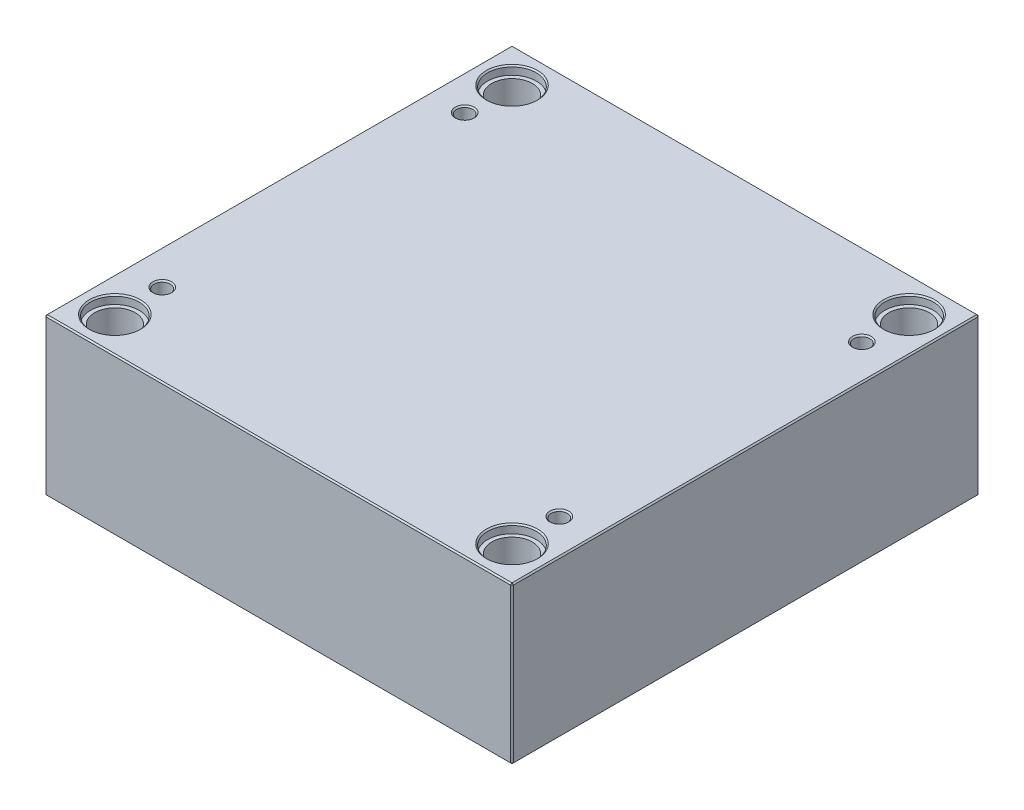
ISO-10303-21;
HEADER;
FILE_DESCRIPTION(('STEP AP214'),'2;1');
FILE_NAME('part.step','',(''),(''),'','','');
FILE_SCHEMA(('AUTOMOTIVE_DESIGN { 1 0 10303 214 1 1 1 1 }'));
ENDSEC;
DATA;
#1=APPLICATION_CONTEXT('core data for automotive mechanical design processes');
#2=APPLICATION_PROTOCOL_DEFINITION('international standard','automotive_design',2000,#1);
#3=PRODUCT_CONTEXT('',#1,'mechanical');
#4=PRODUCT('Part','Part','',(#3));
#5=PRODUCT_RELATED_PRODUCT_CATEGORY('part','',(#4));
#6=PRODUCT_DEFINITION_FORMATION('','',#4);
#7=PRODUCT_DEFINITION_CONTEXT('part definition',#1,'design');
#8=PRODUCT_DEFINITION('design','',#6,#7);
#9=PRODUCT_DEFINITION_SHAPE('','',#8);
#10=(LENGTH_UNIT() NAMED_UNIT(*) SI_UNIT(.MILLI.,.METRE.));
#11=(NAMED_UNIT(*) PLANE_ANGLE_UNIT() SI_UNIT($,.RADIAN.));
#12=(NAMED_UNIT(*) SI_UNIT($,.STERADIAN.) SOLID_ANGLE_UNIT());
#13=UNCERTAINTY_MEASURE_WITH_UNIT(LENGTH_MEASURE(1.E-05),#10,'distance_accuracy_value','');
#14=(GEOMETRIC_REPRESENTATION_CONTEXT(3) GLOBAL_UNCERTAINTY_ASSIGNED_CONTEXT((#13)) GLOBAL_UNIT_ASSIGNED_CONTEXT((#10,
#11,#12)) REPRESENTATION_CONTEXT('',''));
#15=CARTESIAN_POINT('',(0.,0.,0.));
#16=DIRECTION('',(0.,0.,1.));
#17=DIRECTION('',(1.,0.,0.));
#18=AXIS2_PLACEMENT_3D('',#15,#16,#17);
#19=CARTESIAN_POINT('',(-147.,0.,-147.));
#20=DIRECTION('',(0.,1.,0.));
#21=DIRECTION('',(0.,0.,1.));
#22=AXIS2_PLACEMENT_3D('',#19,#20,#21);
#23=CYLINDRICAL_SURFACE('',#22,15.);
#24=CARTESIAN_POINT('',(-147.,0.999999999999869,-147.));
#25=DIRECTION('',(0.,1.,0.));
#26=DIRECTION('',(0.,0.,1.));
#27=AXIS2_PLACEMENT_3D('',#24,#25,#26);
#28=CIRCLE('',#27,15.);
#29=CARTESIAN_POINT('',(-147.,0.999999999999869,-132.));
#30=VERTEX_POINT('',#29);
#31=EDGE_CURVE('E472',#30,#30,#28,.F.);
#32=ORIENTED_EDGE('',*,*,#31,.T.);
#33=EDGE_LOOP('',(#32));
#34=FACE_BOUND('',#33,.T.);
#35=CARTESIAN_POINT('',(-147.,109.7,-147.));
#36=DIRECTION('',(0.,1.,0.));
#37=DIRECTION('',(0.,0.,1.));
#38=AXIS2_PLACEMENT_3D('',#35,#36,#37);
#39=CIRCLE('',#38,15.);
#40=CARTESIAN_POINT('',(-147.,109.7,-132.));
#41=VERTEX_POINT('',#40);
#42=EDGE_CURVE('E221',#41,#41,#39,.F.);
#43=ORIENTED_EDGE('',*,*,#42,.F.);
#44=EDGE_LOOP('',(#43));
#45=FACE_BOUND('',#44,.T.);
#46=ADVANCED_FACE('F16',(#34,#45),#23,.F.);
#47=CARTESIAN_POINT('',(147.,0.,-147.));
#48=DIRECTION('',(0.,1.,0.));
#49=DIRECTION('',(0.,0.,1.));
#50=AXIS2_PLACEMENT_3D('',#47,#48,#49);
#51=CYLINDRICAL_SURFACE('',#50,15.);
#52=CARTESIAN_POINT('',(147.,0.999999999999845,-147.));
#53=DIRECTION('',(0.,1.,0.));
#54=DIRECTION('',(0.,0.,1.));
#55=AXIS2_PLACEMENT_3D('',#52,#53,#54);
#56=CIRCLE('',#55,15.);
#57=CARTESIAN_POINT('',(147.,0.999999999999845,-132.));
#58=VERTEX_POINT('',#57);
#59=EDGE_CURVE('E474',#58,#58,#56,.F.);
#60=ORIENTED_EDGE('',*,*,#59,.T.);
#61=EDGE_LOOP('',(#60));
#62=FACE_BOUND('',#61,.T.);
#63=CARTESIAN_POINT('',(147.,109.7,-147.));
#64=DIRECTION('',(0.,1.,0.));
#65=DIRECTION('',(0.,0.,1.));
#66=AXIS2_PLACEMENT_3D('',#63,#64,#65);
#67=CIRCLE('',#66,15.);
#68=CARTESIAN_POINT('',(147.,109.7,-132.));
#69=VERTEX_POINT('',#68);
#70=EDGE_CURVE('E218',#69,#69,#67,.F.);
#71=ORIENTED_EDGE('',*,*,#70,.F.);
#72=EDGE_LOOP('',(#71));
#73=FACE_BOUND('',#72,.T.);
#74=ADVANCED_FACE('F263',(#62,#73),#51,.F.);
#75=CARTESIAN_POINT('',(147.,0.,147.));
#76=DIRECTION('',(0.,1.,0.));
#77=DIRECTION('',(0.,0.,1.));
#78=AXIS2_PLACEMENT_3D('',#75,#76,#77);
#79=CYLINDRICAL_SURFACE('',#78,15.);
#80=CARTESIAN_POINT('',(147.,0.999999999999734,147.));
#81=DIRECTION('',(0.,1.,0.));
#82=DIRECTION('',(0.,0.,1.));
#83=AXIS2_PLACEMENT_3D('',#80,#81,#82);
#84=CIRCLE('',#83,15.);
#85=CARTESIAN_POINT('',(147.,0.999999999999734,162.));
#86=VERTEX_POINT('',#85);
#87=EDGE_CURVE('E477',#86,#86,#84,.F.);
#88=ORIENTED_EDGE('',*,*,#87,.T.);
#89=EDGE_LOOP('',(#88));
#90=FACE_BOUND('',#89,.T.);
#91=CARTESIAN_POINT('',(147.,109.7,147.));
#92=DIRECTION('',(0.,1.,0.));
#93=DIRECTION('',(0.,0.,1.));
#94=AXIS2_PLACEMENT_3D('',#91,#92,#93);
#95=CIRCLE('',#94,15.);
#96=CARTESIAN_POINT('',(147.,109.7,162.));
#97=VERTEX_POINT('',#96);
#98=EDGE_CURVE('E214',#97,#97,#95,.F.);
#99=ORIENTED_EDGE('',*,*,#98,.F.);
#100=EDGE_LOOP('',(#99));
#101=FACE_BOUND('',#100,.T.);
#102=ADVANCED_FACE('F270',(#90,#101),#79,.F.);
#103=CARTESIAN_POINT('',(-147.,0.,147.));
#104=DIRECTION('',(0.,1.,0.));
#105=DIRECTION('',(0.,0.,1.));
#106=AXIS2_PLACEMENT_3D('',#103,#104,#105);
#107=CYLINDRICAL_SURFACE('',#106,15.);
#108=CARTESIAN_POINT('',(-147.,0.999999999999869,147.));
#109=DIRECTION('',(0.,1.,0.));
#110=DIRECTION('',(0.,0.,1.));
#111=AXIS2_PLACEMENT_3D('',#108,#109,#110);
#112=CIRCLE('',#111,15.);
#113=CARTESIAN_POINT('',(-147.,0.999999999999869,162.));
#114=VERTEX_POINT('',#113);
#115=EDGE_CURVE('E480',#114,#114,#112,.F.);
#116=ORIENTED_EDGE('',*,*,#115,.T.);
#117=EDGE_LOOP('',(#116));
#118=FACE_BOUND('',#117,.T.);
#119=CARTESIAN_POINT('',(-147.,109.7,147.));
#120=DIRECTION('',(0.,1.,0.));
#121=DIRECTION('',(0.,0.,1.));
#122=AXIS2_PLACEMENT_3D('',#119,#120,#121);
#123=CIRCLE('',#122,15.);
#124=CARTESIAN_POINT('',(-147.,109.7,162.));
#125=VERTEX_POINT('',#124);
#126=EDGE_CURVE('E211',#125,#125,#123,.F.);
#127=ORIENTED_EDGE('',*,*,#126,.F.);
#128=EDGE_LOOP('',(#127));
#129=FACE_BOUND('',#128,.T.);
#130=ADVANCED_FACE('F277',(#118,#129),#107,.F.);
#131=CARTESIAN_POINT('',(-173.,116.,173.));
#132=DIRECTION('',(1.,0.,0.));
#133=DIRECTION('',(0.,0.,-1.));
#134=AXIS2_PLACEMENT_3D('',#131,#132,#133);
#135=PLANE('',#134);
#136=DIRECTION('',(0.,-1.,0.));
#137=VECTOR('',#136,1.);
#138=CARTESIAN_POINT('',(-173.,116.,-172.));
#139=LINE('',#138,#137);
#140=CARTESIAN_POINT('',(-173.,115.,-172.));
#141=VERTEX_POINT('',#140);
#142=CARTESIAN_POINT('',(-173.,1.00000000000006,-172.));
#143=VERTEX_POINT('',#142);
#144=EDGE_CURVE('E487',#141,#143,#139,.T.);
#145=ORIENTED_EDGE('',*,*,#144,.T.);
#146=DIRECTION('',(0.,0.,1.));
#147=VECTOR('',#146,1.);
#148=CARTESIAN_POINT('',(-173.,1.00000000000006,173.));
#149=LINE('',#148,#147);
#150=CARTESIAN_POINT('',(-173.,1.00000000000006,172.));
#151=VERTEX_POINT('',#150);
#152=EDGE_CURVE('E490',#143,#151,#149,.T.);
#153=ORIENTED_EDGE('',*,*,#152,.T.);
#154=DIRECTION('',(0.,1.,0.));
#155=VECTOR('',#154,1.);
#156=CARTESIAN_POINT('',(-173.,116.,172.));
#157=LINE('',#156,#155);
#158=CARTESIAN_POINT('',(-173.,115.,172.));
#159=VERTEX_POINT('',#158);
#160=EDGE_CURVE('E485',#151,#159,#157,.T.);
#161=ORIENTED_EDGE('',*,*,#160,.T.);
#162=DIRECTION('',(0.,0.,-1.));
#163=VECTOR('',#162,1.);
#164=CARTESIAN_POINT('',(-173.,115.,-173.));
#165=LINE('',#164,#163);
#166=EDGE_CURVE('E483',#159,#141,#165,.T.);
#167=ORIENTED_EDGE('',*,*,#166,.T.);
#168=EDGE_LOOP('',(#145,#153,#161,#167));
#169=FACE_BOUND('',#168,.T.);
#170=ADVANCED_FACE('F298',(#169),#135,.F.);
#171=CARTESIAN_POINT('',(173.,116.,173.));
#172=DIRECTION('',(0.,0.,-1.));
#173=DIRECTION('',(-1.,0.,0.));
#174=AXIS2_PLACEMENT_3D('',#171,#172,#173);
#175=PLANE('',#174);
#176=DIRECTION('',(-1.,0.,0.));
#177=VECTOR('',#176,1.);
#178=CARTESIAN_POINT('',(-173.,115.,173.));
#179=LINE('',#178,#177);
#180=CARTESIAN_POINT('',(172.,115.,173.));
#181=VERTEX_POINT('',#180);
#182=CARTESIAN_POINT('',(-172.,115.,173.));
#183=VERTEX_POINT('',#182);
#184=EDGE_CURVE('E509',#181,#183,#179,.T.);
#185=ORIENTED_EDGE('',*,*,#184,.T.);
#186=DIRECTION('',(0.,-1.,0.));
#187=VECTOR('',#186,1.);
#188=CARTESIAN_POINT('',(-172.,116.,173.));
#189=LINE('',#188,#187);
#190=CARTESIAN_POINT('',(-172.,1.00000000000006,173.));
#191=VERTEX_POINT('',#190);
#192=EDGE_CURVE('E515',#183,#191,#189,.T.);
#193=ORIENTED_EDGE('',*,*,#192,.T.);
#194=DIRECTION('',(1.,0.,0.));
#195=VECTOR('',#194,1.);
#196=CARTESIAN_POINT('',(173.,1.00000000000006,173.));
#197=LINE('',#196,#195);
#198=CARTESIAN_POINT('',(172.,1.00000000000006,173.));
#199=VERTEX_POINT('',#198);
#200=EDGE_CURVE('E513',#191,#199,#197,.T.);
#201=ORIENTED_EDGE('',*,*,#200,.T.);
#202=DIRECTION('',(0.,1.,0.));
#203=VECTOR('',#202,1.);
#204=CARTESIAN_POINT('',(172.,116.,173.));
#205=LINE('',#204,#203);
#206=EDGE_CURVE('E511',#199,#181,#205,.T.);
#207=ORIENTED_EDGE('',*,*,#206,.T.);
#208=EDGE_LOOP('',(#185,#193,#201,#207));
#209=FACE_BOUND('',#208,.T.);
#210=ADVANCED_FACE('F294',(#209),#175,.F.);
#211=CARTESIAN_POINT('',(173.,116.,173.));
#212=DIRECTION('',(-1.,0.,0.));
#213=DIRECTION('',(0.,0.,1.));
#214=AXIS2_PLACEMENT_3D('',#211,#212,#213);
#215=PLANE('',#214);
#216=DIRECTION('',(0.,0.,-1.));
#217=VECTOR('',#216,1.);
#218=CARTESIAN_POINT('',(173.,1.00000000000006,173.));
#219=LINE('',#218,#217);
#220=CARTESIAN_POINT('',(173.,1.00000000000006,172.));
#221=VERTEX_POINT('',#220);
#222=CARTESIAN_POINT('',(173.,1.00000000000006,-172.));
#223=VERTEX_POINT('',#222);
#224=EDGE_CURVE('E504',#221,#223,#219,.T.);
#225=ORIENTED_EDGE('',*,*,#224,.T.);
#226=DIRECTION('',(0.,1.,0.));
#227=VECTOR('',#226,1.);
#228=CARTESIAN_POINT('',(173.,116.,-172.));
#229=LINE('',#228,#227);
#230=CARTESIAN_POINT('',(173.,115.,-172.));
#231=VERTEX_POINT('',#230);
#232=EDGE_CURVE('E506',#223,#231,#229,.T.);
#233=ORIENTED_EDGE('',*,*,#232,.T.);
#234=DIRECTION('',(0.,0.,1.));
#235=VECTOR('',#234,1.);
#236=CARTESIAN_POINT('',(173.,115.,173.));
#237=LINE('',#236,#235);
#238=CARTESIAN_POINT('',(173.,115.,172.));
#239=VERTEX_POINT('',#238);
#240=EDGE_CURVE('E500',#231,#239,#237,.T.);
#241=ORIENTED_EDGE('',*,*,#240,.T.);
#242=DIRECTION('',(0.,-1.,0.));
#243=VECTOR('',#242,1.);
#244=CARTESIAN_POINT('',(173.,116.,172.));
#245=LINE('',#244,#243);
#246=EDGE_CURVE('E502',#239,#221,#245,.T.);
#247=ORIENTED_EDGE('',*,*,#246,.T.);
#248=EDGE_LOOP('',(#225,#233,#241,#247));
#249=FACE_BOUND('',#248,.T.);
#250=ADVANCED_FACE('F290',(#249),#215,.F.);
#251=CARTESIAN_POINT('',(173.,116.,-173.));
#252=DIRECTION('',(0.,0.,1.));
#253=DIRECTION('',(1.,0.,0.));
#254=AXIS2_PLACEMENT_3D('',#251,#252,#253);
#255=PLANE('',#254);
#256=DIRECTION('',(0.,-1.,0.));
#257=VECTOR('',#256,1.);
#258=CARTESIAN_POINT('',(172.,116.,-173.));
#259=LINE('',#258,#257);
#260=CARTESIAN_POINT('',(172.,115.,-173.));
#261=VERTEX_POINT('',#260);
#262=CARTESIAN_POINT('',(172.,1.00000000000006,-173.));
#263=VERTEX_POINT('',#262);
#264=EDGE_CURVE('E494',#261,#263,#259,.T.);
#265=ORIENTED_EDGE('',*,*,#264,.T.);
#266=DIRECTION('',(-1.,0.,0.));
#267=VECTOR('',#266,1.);
#268=CARTESIAN_POINT('',(173.,1.00000000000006,-173.));
#269=LINE('',#268,#267);
#270=CARTESIAN_POINT('',(-172.,1.00000000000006,-173.));
#271=VERTEX_POINT('',#270);
#272=EDGE_CURVE('E138',#263,#271,#269,.T.);
#273=ORIENTED_EDGE('',*,*,#272,.T.);
#274=DIRECTION('',(0.,1.,0.));
#275=VECTOR('',#274,1.);
#276=CARTESIAN_POINT('',(-172.,116.,-173.));
#277=LINE('',#276,#275);
#278=CARTESIAN_POINT('',(-172.,115.,-173.));
#279=VERTEX_POINT('',#278);
#280=EDGE_CURVE('E496',#271,#279,#277,.T.);
#281=ORIENTED_EDGE('',*,*,#280,.T.);
#282=DIRECTION('',(1.,0.,0.));
#283=VECTOR('',#282,1.);
#284=CARTESIAN_POINT('',(173.,115.,-173.));
#285=LINE('',#284,#283);
#286=EDGE_CURVE('E492',#279,#261,#285,.T.);
#287=ORIENTED_EDGE('',*,*,#286,.T.);
#288=EDGE_LOOP('',(#265,#273,#281,#287));
#289=FACE_BOUND('',#288,.T.);
#290=ADVANCED_FACE('F282',(#289),#255,.F.);
#291=CARTESIAN_POINT('',(0.,116.,0.));
#292=DIRECTION('',(0.,1.,0.));
#293=DIRECTION('',(0.,0.,1.));
#294=AXIS2_PLACEMENT_3D('',#291,#292,#293);
#295=PLANE('',#294);
#296=CARTESIAN_POINT('',(147.,116.,147.));
#297=DIRECTION('',(0.,1.,0.));
#298=DIRECTION('',(0.,0.,1.));
#299=AXIS2_PLACEMENT_3D('',#296,#297,#298);
#300=CIRCLE('',#299,19.);
#301=CARTESIAN_POINT('',(147.,116.,166.));
#302=VERTEX_POINT('',#301);
#303=EDGE_CURVE('E236',#302,#302,#300,.F.);
#304=ORIENTED_EDGE('',*,*,#303,.T.);
#305=EDGE_LOOP('',(#304));
#306=FACE_BOUND('',#305,.T.);
#307=CARTESIAN_POINT('',(-147.,116.,147.));
#308=DIRECTION('',(0.,1.,0.));
#309=DIRECTION('',(0.,0.,1.));
#310=AXIS2_PLACEMENT_3D('',#307,#308,#309);
#311=CIRCLE('',#310,19.);
#312=CARTESIAN_POINT('',(-147.,116.,166.));
#313=VERTEX_POINT('',#312);
#314=EDGE_CURVE('E233',#313,#313,#311,.F.);
#315=ORIENTED_EDGE('',*,*,#314,.T.);
#316=EDGE_LOOP('',(#315));
#317=FACE_BOUND('',#316,.T.);
#318=CARTESIAN_POINT('',(147.,116.,-147.));
#319=DIRECTION('',(0.,1.,0.));
#320=DIRECTION('',(0.,0.,1.));
#321=AXIS2_PLACEMENT_3D('',#318,#319,#320);
#322=CIRCLE('',#321,19.);
#323=CARTESIAN_POINT('',(147.,116.,-128.));
#324=VERTEX_POINT('',#323);
#325=EDGE_CURVE('E230',#324,#324,#322,.F.);
#326=ORIENTED_EDGE('',*,*,#325,.T.);
#327=EDGE_LOOP('',(#326));
#328=FACE_BOUND('',#327,.T.);
#329=CARTESIAN_POINT('',(-147.,116.,-147.));
#330=DIRECTION('',(0.,1.,0.));
#331=DIRECTION('',(0.,0.,1.));
#332=AXIS2_PLACEMENT_3D('',#329,#330,#331);
#333=CIRCLE('',#332,19.);
#334=CARTESIAN_POINT('',(-147.,116.,-128.));
#335=VERTEX_POINT('',#334);
#336=EDGE_CURVE('E227',#335,#335,#333,.F.);
#337=ORIENTED_EDGE('',*,*,#336,.T.);
#338=EDGE_LOOP('',(#337));
#339=FACE_BOUND('',#338,.T.);
#340=CARTESIAN_POINT('',(-147.,116.,112.));
#341=DIRECTION('',(0.,1.,0.));
#342=DIRECTION('',(0.,0.,1.));
#343=AXIS2_PLACEMENT_3D('',#340,#341,#342);
#344=CIRCLE('',#343,6.9999999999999);
#345=CARTESIAN_POINT('',(-147.,116.,119.));
#346=VERTEX_POINT('',#345);
#347=EDGE_CURVE('E198',#346,#346,#344,.F.);
#348=ORIENTED_EDGE('',*,*,#347,.T.);
#349=EDGE_LOOP('',(#348));
#350=FACE_BOUND('',#349,.T.);
#351=CARTESIAN_POINT('',(147.,116.,112.));
#352=DIRECTION('',(0.,1.,0.));
#353=DIRECTION('',(0.,0.,1.));
#354=AXIS2_PLACEMENT_3D('',#351,#352,#353);
#355=CIRCLE('',#354,6.9999999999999);
#356=CARTESIAN_POINT('',(147.,116.,119.));
#357=VERTEX_POINT('',#356);
#358=EDGE_CURVE('E195',#357,#357,#355,.F.);
#359=ORIENTED_EDGE('',*,*,#358,.T.);
#360=EDGE_LOOP('',(#359));
#361=FACE_BOUND('',#360,.T.);
#362=CARTESIAN_POINT('',(147.,116.,-112.));
#363=DIRECTION('',(0.,1.,0.));
#364=DIRECTION('',(0.,0.,1.));
#365=AXIS2_PLACEMENT_3D('',#362,#363,#364);
#366=CIRCLE('',#365,6.9999999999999);
#367=CARTESIAN_POINT('',(147.,116.,-105.));
#368=VERTEX_POINT('',#367);
#369=EDGE_CURVE('E192',#368,#368,#366,.F.);
#370=ORIENTED_EDGE('',*,*,#369,.T.);
#371=EDGE_LOOP('',(#370));
#372=FACE_BOUND('',#371,.T.);
#373=CARTESIAN_POINT('',(-147.,116.,-112.));
#374=DIRECTION('',(0.,1.,0.));
#375=DIRECTION('',(0.,0.,1.));
#376=AXIS2_PLACEMENT_3D('',#373,#374,#375);
#377=CIRCLE('',#376,6.9999999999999);
#378=CARTESIAN_POINT('',(-147.,116.,-105.));
#379=VERTEX_POINT('',#378);
#380=EDGE_CURVE('E188',#379,#379,#377,.F.);
#381=ORIENTED_EDGE('',*,*,#380,.T.);
#382=EDGE_LOOP('',(#381));
#383=FACE_BOUND('',#382,.T.);
#384=DIRECTION('',(0.,0.,-1.));
#385=VECTOR('',#384,1.);
#386=CARTESIAN_POINT('',(172.,116.,-173.));
#387=LINE('',#386,#385);
#388=CARTESIAN_POINT('',(172.,116.,172.));
#389=VERTEX_POINT('',#388);
#390=CARTESIAN_POINT('',(172.,116.,-172.));
#391=VERTEX_POINT('',#390);
#392=EDGE_CURVE('E31',#389,#391,#387,.T.);
#393=ORIENTED_EDGE('',*,*,#392,.T.);
#394=DIRECTION('',(-1.,0.,0.));
#395=VECTOR('',#394,1.);
#396=CARTESIAN_POINT('',(-173.,116.,-172.));
#397=LINE('',#396,#395);
#398=CARTESIAN_POINT('',(-172.,116.,-172.));
#399=VERTEX_POINT('',#398);
#400=EDGE_CURVE('E189',#391,#399,#397,.T.);
#401=ORIENTED_EDGE('',*,*,#400,.T.);
#402=DIRECTION('',(0.,0.,1.));
#403=VECTOR('',#402,1.);
#404=CARTESIAN_POINT('',(-172.,116.,173.));
#405=LINE('',#404,#403);
#406=CARTESIAN_POINT('',(-172.,116.,172.));
#407=VERTEX_POINT('',#406);
#408=EDGE_CURVE('E518',#399,#407,#405,.T.);
#409=ORIENTED_EDGE('',*,*,#408,.T.);
#410=DIRECTION('',(1.,0.,0.));
#411=VECTOR('',#410,1.);
#412=CARTESIAN_POINT('',(173.,116.,172.));
#413=LINE('',#412,#411);
#414=EDGE_CURVE('E36',#407,#389,#413,.T.);
#415=ORIENTED_EDGE('',*,*,#414,.T.);
#416=EDGE_LOOP('',(#393,#401,#409,#415));
#417=FACE_BOUND('',#416,.T.);
#418=ADVANCED_FACE('F279',(#306,#317,#328,#339,#350,#361,#372,#383,#417),#295,.T.);
#419=CARTESIAN_POINT('',(0.,0.,0.));
#420=DIRECTION('',(0.,1.,0.));
#421=DIRECTION('',(0.,0.,1.));
#422=AXIS2_PLACEMENT_3D('',#419,#420,#421);
#423=PLANE('',#422);
#424=CARTESIAN_POINT('',(-147.,0.,-147.));
#425=DIRECTION('',(0.,1.,0.));
#426=DIRECTION('',(0.,0.,1.));
#427=AXIS2_PLACEMENT_3D('',#424,#425,#426);
#428=CIRCLE('',#427,16.);
#429=CARTESIAN_POINT('',(-147.,0.,-131.));
#430=VERTEX_POINT('',#429);
#431=EDGE_CURVE('E469',#430,#430,#428,.T.);
#432=ORIENTED_EDGE('',*,*,#431,.T.);
#433=EDGE_LOOP('',(#432));
#434=FACE_BOUND('',#433,.T.);
#435=CARTESIAN_POINT('',(147.,0.,-147.));
#436=DIRECTION('',(0.,1.,0.));
#437=DIRECTION('',(0.,0.,1.));
#438=AXIS2_PLACEMENT_3D('',#435,#436,#437);
#439=CIRCLE('',#438,16.);
#440=CARTESIAN_POINT('',(147.,0.,-131.));
#441=VERTEX_POINT('',#440);
#442=EDGE_CURVE('E466',#441,#441,#439,.T.);
#443=ORIENTED_EDGE('',*,*,#442,.T.);
#444=EDGE_LOOP('',(#443));
#445=FACE_BOUND('',#444,.T.);
#446=CARTESIAN_POINT('',(147.,0.,147.));
#447=DIRECTION('',(0.,1.,0.));
#448=DIRECTION('',(0.,0.,1.));
#449=AXIS2_PLACEMENT_3D('',#446,#447,#448);
#450=CIRCLE('',#449,16.);
#451=CARTESIAN_POINT('',(147.,0.,163.));
#452=VERTEX_POINT('',#451);
#453=EDGE_CURVE('E463',#452,#452,#450,.T.);
#454=ORIENTED_EDGE('',*,*,#453,.T.);
#455=EDGE_LOOP('',(#454));
#456=FACE_BOUND('',#455,.T.);
#457=CARTESIAN_POINT('',(-147.,0.,147.));
#458=DIRECTION('',(0.,1.,0.));
#459=DIRECTION('',(0.,0.,1.));
#460=AXIS2_PLACEMENT_3D('',#457,#458,#459);
#461=CIRCLE('',#460,16.);
#462=CARTESIAN_POINT('',(-147.,0.,163.));
#463=VERTEX_POINT('',#462);
#464=EDGE_CURVE('E460',#463,#463,#461,.T.);
#465=ORIENTED_EDGE('',*,*,#464,.T.);
#466=EDGE_LOOP('',(#465));
#467=FACE_BOUND('',#466,.T.);
#468=DIRECTION('',(0.,0.,1.));
#469=VECTOR('',#468,1.);
#470=CARTESIAN_POINT('',(172.,0.,0.));
#471=LINE('',#470,#469);
#472=CARTESIAN_POINT('',(172.,0.,-172.));
#473=VERTEX_POINT('',#472);
#474=CARTESIAN_POINT('',(172.,0.,172.));
#475=VERTEX_POINT('',#474);
#476=EDGE_CURVE('E108',#473,#475,#471,.T.);
#477=ORIENTED_EDGE('',*,*,#476,.T.);
#478=DIRECTION('',(-1.,0.,0.));
#479=VECTOR('',#478,1.);
#480=CARTESIAN_POINT('',(0.,0.,172.));
#481=LINE('',#480,#479);
#482=CARTESIAN_POINT('',(-172.,0.,172.));
#483=VERTEX_POINT('',#482);
#484=EDGE_CURVE('E458',#475,#483,#481,.T.);
#485=ORIENTED_EDGE('',*,*,#484,.T.);
#486=DIRECTION('',(0.,0.,-1.));
#487=VECTOR('',#486,1.);
#488=CARTESIAN_POINT('',(-172.,0.,0.));
#489=LINE('',#488,#487);
#490=CARTESIAN_POINT('',(-172.,0.,-172.));
#491=VERTEX_POINT('',#490);
#492=EDGE_CURVE('E110',#483,#491,#489,.T.);
#493=ORIENTED_EDGE('',*,*,#492,.T.);
#494=DIRECTION('',(1.,0.,0.));
#495=VECTOR('',#494,1.);
#496=CARTESIAN_POINT('',(0.,0.,-172.));
#497=LINE('',#496,#495);
#498=EDGE_CURVE('E104',#491,#473,#497,.T.);
#499=ORIENTED_EDGE('',*,*,#498,.T.);
#500=EDGE_LOOP('',(#477,#485,#493,#499));
#501=FACE_BOUND('',#500,.T.);
#502=ADVANCED_FACE('F106',(#434,#445,#456,#467,#501),#423,.F.);
#503=CARTESIAN_POINT('',(-147.,0.,-147.));
#504=DIRECTION('',(0.,-1.,0.));
#505=DIRECTION('',(0.,0.,-1.));
#506=AXIS2_PLACEMENT_3D('',#503,#504,#505);
#507=CONICAL_SURFACE('',#506,16.,0.785398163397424);
#508=ORIENTED_EDGE('',*,*,#31,.F.);
#509=EDGE_LOOP('',(#508));
#510=FACE_BOUND('',#509,.T.);
#511=ORIENTED_EDGE('',*,*,#431,.F.);
#512=EDGE_LOOP('',(#511));
#513=FACE_BOUND('',#512,.T.);
#514=ADVANCED_FACE('F286',(#510,#513),#507,.F.);
#515=CARTESIAN_POINT('',(147.,0.,-147.));
#516=DIRECTION('',(0.,-1.,0.));
#517=DIRECTION('',(0.,0.,-1.));
#518=AXIS2_PLACEMENT_3D('',#515,#516,#517);
#519=CONICAL_SURFACE('',#518,16.,0.785398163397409);
#520=ORIENTED_EDGE('',*,*,#59,.F.);
#521=EDGE_LOOP('',(#520));
#522=FACE_BOUND('',#521,.T.);
#523=ORIENTED_EDGE('',*,*,#442,.F.);
#524=EDGE_LOOP('',(#523));
#525=FACE_BOUND('',#524,.T.);
#526=ADVANCED_FACE('F305',(#522,#525),#519,.F.);
#527=CARTESIAN_POINT('',(147.,0.,147.));
#528=DIRECTION('',(0.,-1.,0.));
#529=DIRECTION('',(0.,0.,-1.));
#530=AXIS2_PLACEMENT_3D('',#527,#528,#529);
#531=CONICAL_SURFACE('',#530,16.,0.78539816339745);
#532=ORIENTED_EDGE('',*,*,#87,.F.);
#533=EDGE_LOOP('',(#532));
#534=FACE_BOUND('',#533,.T.);
#535=ORIENTED_EDGE('',*,*,#453,.F.);
#536=EDGE_LOOP('',(#535));
#537=FACE_BOUND('',#536,.T.);
#538=ADVANCED_FACE('F309',(#534,#537),#531,.F.);
#539=CARTESIAN_POINT('',(-147.,0.,147.));
#540=DIRECTION('',(0.,-1.,0.));
#541=DIRECTION('',(0.,0.,-1.));
#542=AXIS2_PLACEMENT_3D('',#539,#540,#541);
#543=CONICAL_SURFACE('',#542,16.,0.785398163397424);
#544=ORIENTED_EDGE('',*,*,#115,.F.);
#545=EDGE_LOOP('',(#544));
#546=FACE_BOUND('',#545,.T.);
#547=ORIENTED_EDGE('',*,*,#464,.F.);
#548=EDGE_LOOP('',(#547));
#549=FACE_BOUND('',#548,.T.);
#550=ADVANCED_FACE('F313',(#546,#549),#543,.F.);
#551=CARTESIAN_POINT('',(173.,116.,172.));
#552=DIRECTION('',(-0.707106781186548,0.,-0.707106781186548));
#553=DIRECTION('',(0.,-1.,0.));
#554=AXIS2_PLACEMENT_3D('',#551,#552,#553);
#555=PLANE('',#554);
#556=DIRECTION('',(-0.707106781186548,0.,0.707106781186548));
#557=VECTOR('',#556,1.);
#558=CARTESIAN_POINT('',(172.,115.,173.));
#559=LINE('',#558,#557);
#560=EDGE_CURVE('E126',#181,#239,#559,.F.);
#561=ORIENTED_EDGE('',*,*,#560,.F.);
#562=ORIENTED_EDGE('',*,*,#206,.F.);
#563=DIRECTION('',(0.707106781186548,0.,-0.707106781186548));
#564=VECTOR('',#563,1.);
#565=CARTESIAN_POINT('',(172.,1.00000000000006,173.));
#566=LINE('',#565,#564);
#567=EDGE_CURVE('E180',#221,#199,#566,.F.);
#568=ORIENTED_EDGE('',*,*,#567,.F.);
#569=ORIENTED_EDGE('',*,*,#246,.F.);
#570=EDGE_LOOP('',(#561,#562,#568,#569));
#571=FACE_BOUND('',#570,.T.);
#572=ADVANCED_FACE('F317',(#571),#555,.F.);
#573=CARTESIAN_POINT('',(172.,115.,173.));
#574=DIRECTION('',(0.577350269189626,0.577350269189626,0.577350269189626));
#575=DIRECTION('',(0.707106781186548,0.,-0.707106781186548));
#576=AXIS2_PLACEMENT_3D('',#573,#574,#575);
#577=PLANE('',#576);
#578=DIRECTION('',(0.,-0.707106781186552,0.707106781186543));
#579=VECTOR('',#578,1.);
#580=CARTESIAN_POINT('',(172.,115.,173.));
#581=LINE('',#580,#579);
#582=EDGE_CURVE('E175',#181,#389,#581,.F.);
#583=ORIENTED_EDGE('',*,*,#582,.F.);
#584=ORIENTED_EDGE('',*,*,#560,.T.);
#585=DIRECTION('',(-0.707106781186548,0.707106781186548,0.));
#586=VECTOR('',#585,1.);
#587=CARTESIAN_POINT('',(172.5,115.5,172.));
#588=LINE('',#587,#586);
#589=EDGE_CURVE('E177',#389,#239,#588,.F.);
#590=ORIENTED_EDGE('',*,*,#589,.F.);
#591=EDGE_LOOP('',(#583,#584,#590));
#592=FACE_BOUND('',#591,.T.);
#593=ADVANCED_FACE('F385',(#592),#577,.T.);
#594=CARTESIAN_POINT('',(172.,1.00000000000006,173.));
#595=DIRECTION('',(0.577350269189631,-0.577350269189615,0.577350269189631));
#596=DIRECTION('',(0.707106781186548,0.,-0.707106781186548));
#597=AXIS2_PLACEMENT_3D('',#594,#595,#596);
#598=PLANE('',#597);
#599=DIRECTION('',(-0.707106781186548,-0.707106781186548,0.));
#600=VECTOR('',#599,1.);
#601=CARTESIAN_POINT('',(172.5,0.500000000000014,172.));
#602=LINE('',#601,#600);
#603=EDGE_CURVE('E124',#221,#475,#602,.T.);
#604=ORIENTED_EDGE('',*,*,#603,.F.);
#605=ORIENTED_EDGE('',*,*,#567,.T.);
#606=DIRECTION('',(0.,0.707106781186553,0.707106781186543));
#607=VECTOR('',#606,1.);
#608=CARTESIAN_POINT('',(172.,1.00000000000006,173.));
#609=LINE('',#608,#607);
#610=EDGE_CURVE('E172',#475,#199,#609,.T.);
#611=ORIENTED_EDGE('',*,*,#610,.F.);
#612=EDGE_LOOP('',(#604,#605,#611));
#613=FACE_BOUND('',#612,.T.);
#614=ADVANCED_FACE('F381',(#613),#598,.T.);
#615=CARTESIAN_POINT('',(172.,116.,0.));
#616=DIRECTION('',(0.707106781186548,0.707106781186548,0.));
#617=DIRECTION('',(0.,0.,1.));
#618=AXIS2_PLACEMENT_3D('',#615,#616,#617);
#619=PLANE('',#618);
#620=ORIENTED_EDGE('',*,*,#589,.T.);
#621=ORIENTED_EDGE('',*,*,#240,.F.);
#622=DIRECTION('',(0.707106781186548,-0.707106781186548,0.));
#623=VECTOR('',#622,1.);
#624=CARTESIAN_POINT('',(173.,115.,-172.));
#625=LINE('',#624,#623);
#626=EDGE_CURVE('E166',#391,#231,#625,.T.);
#627=ORIENTED_EDGE('',*,*,#626,.F.);
#628=ORIENTED_EDGE('',*,*,#392,.F.);
#629=EDGE_LOOP('',(#620,#621,#627,#628));
#630=FACE_BOUND('',#629,.T.);
#631=ADVANCED_FACE('F377',(#630),#619,.T.);
#632=CARTESIAN_POINT('',(0.,116.,172.));
#633=DIRECTION('',(0.,0.707106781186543,0.707106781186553));
#634=DIRECTION('',(-1.,0.,0.));
#635=AXIS2_PLACEMENT_3D('',#632,#633,#634);
#636=PLANE('',#635);
#637=ORIENTED_EDGE('',*,*,#582,.T.);
#638=ORIENTED_EDGE('',*,*,#414,.F.);
#639=DIRECTION('',(0.,0.707106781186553,-0.707106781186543));
#640=VECTOR('',#639,1.);
#641=CARTESIAN_POINT('',(-172.,115.5,172.5));
#642=LINE('',#641,#640);
#643=EDGE_CURVE('E163',#183,#407,#642,.T.);
#644=ORIENTED_EDGE('',*,*,#643,.F.);
#645=ORIENTED_EDGE('',*,*,#184,.F.);
#646=EDGE_LOOP('',(#637,#638,#644,#645));
#647=FACE_BOUND('',#646,.T.);
#648=ADVANCED_FACE('F373',(#647),#636,.T.);
#649=CARTESIAN_POINT('',(-172.,116.,173.));
#650=DIRECTION('',(0.707106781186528,0.,-0.707106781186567));
#651=DIRECTION('',(0.,-1.,0.));
#652=AXIS2_PLACEMENT_3D('',#649,#650,#651);
#653=PLANE('',#652);
#654=DIRECTION('',(0.707106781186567,0.,0.707106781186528));
#655=VECTOR('',#654,1.);
#656=CARTESIAN_POINT('',(-172.,1.00000000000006,173.));
#657=LINE('',#656,#655);
#658=EDGE_CURVE('E157',#191,#151,#657,.F.);
#659=ORIENTED_EDGE('',*,*,#658,.F.);
#660=ORIENTED_EDGE('',*,*,#192,.F.);
#661=DIRECTION('',(-0.707106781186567,0.,-0.707106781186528));
#662=VECTOR('',#661,1.);
#663=CARTESIAN_POINT('',(-173.,115.,172.));
#664=LINE('',#663,#662);
#665=EDGE_CURVE('E160',#159,#183,#664,.F.);
#666=ORIENTED_EDGE('',*,*,#665,.F.);
#667=ORIENTED_EDGE('',*,*,#160,.F.);
#668=EDGE_LOOP('',(#659,#660,#666,#667));
#669=FACE_BOUND('',#668,.T.);
#670=ADVANCED_FACE('F369',(#669),#653,.F.);
#671=CARTESIAN_POINT('',(173.,1.00000000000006,173.));
#672=DIRECTION('',(0.,0.707106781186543,-0.707106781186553));
#673=DIRECTION('',(1.,0.,0.));
#674=AXIS2_PLACEMENT_3D('',#671,#672,#673);
#675=PLANE('',#674);
#676=ORIENTED_EDGE('',*,*,#610,.T.);
#677=ORIENTED_EDGE('',*,*,#200,.F.);
#678=DIRECTION('',(0.,-0.707106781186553,-0.707106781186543));
#679=VECTOR('',#678,1.);
#680=CARTESIAN_POINT('',(-172.,1.00000000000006,173.));
#681=LINE('',#680,#679);
#682=EDGE_CURVE('E135',#483,#191,#681,.F.);
#683=ORIENTED_EDGE('',*,*,#682,.F.);
#684=ORIENTED_EDGE('',*,*,#484,.F.);
#685=EDGE_LOOP('',(#676,#677,#683,#684));
#686=FACE_BOUND('',#685,.T.);
#687=ADVANCED_FACE('F366',(#686),#675,.F.);
#688=CARTESIAN_POINT('',(173.,1.00000000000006,173.));
#689=DIRECTION('',(-0.707106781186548,0.707106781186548,0.));
#690=DIRECTION('',(0.,0.,-1.));
#691=AXIS2_PLACEMENT_3D('',#688,#689,#690);
#692=PLANE('',#691);
#693=ORIENTED_EDGE('',*,*,#603,.T.);
#694=ORIENTED_EDGE('',*,*,#476,.F.);
#695=DIRECTION('',(0.707106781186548,0.707106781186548,0.));
#696=VECTOR('',#695,1.);
#697=CARTESIAN_POINT('',(172.5,0.499999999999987,-172.));
#698=LINE('',#697,#696);
#699=EDGE_CURVE('E121',#223,#473,#698,.F.);
#700=ORIENTED_EDGE('',*,*,#699,.F.);
#701=ORIENTED_EDGE('',*,*,#224,.F.);
#702=EDGE_LOOP('',(#693,#694,#700,#701));
#703=FACE_BOUND('',#702,.T.);
#704=ADVANCED_FACE('F119',(#703),#692,.F.);
#705=CARTESIAN_POINT('',(172.,116.,-173.));
#706=DIRECTION('',(-0.707106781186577,0.,0.707106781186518));
#707=DIRECTION('',(0.,-1.,0.));
#708=AXIS2_PLACEMENT_3D('',#705,#706,#707);
#709=PLANE('',#708);
#710=DIRECTION('',(0.707106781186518,0.,0.707106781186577));
#711=VECTOR('',#710,1.);
#712=CARTESIAN_POINT('',(173.,115.,-172.));
#713=LINE('',#712,#711);
#714=EDGE_CURVE('E168',#231,#261,#713,.F.);
#715=ORIENTED_EDGE('',*,*,#714,.F.);
#716=ORIENTED_EDGE('',*,*,#232,.F.);
#717=DIRECTION('',(-0.707106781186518,0.,-0.707106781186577));
#718=VECTOR('',#717,1.);
#719=CARTESIAN_POINT('',(172.,1.00000000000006,-173.));
#720=LINE('',#719,#718);
#721=EDGE_CURVE('E134',#263,#223,#720,.F.);
#722=ORIENTED_EDGE('',*,*,#721,.F.);
#723=ORIENTED_EDGE('',*,*,#264,.F.);
#724=EDGE_LOOP('',(#715,#716,#722,#723));
#725=FACE_BOUND('',#724,.T.);
#726=ADVANCED_FACE('F359',(#725),#709,.F.);
#727=CARTESIAN_POINT('',(173.,115.,-172.));
#728=DIRECTION('',(0.577350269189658,0.57735026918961,-0.57735026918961));
#729=DIRECTION('',(-0.707106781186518,0.,-0.707106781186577));
#730=AXIS2_PLACEMENT_3D('',#727,#728,#729);
#731=PLANE('',#730);
#732=ORIENTED_EDGE('',*,*,#626,.T.);
#733=ORIENTED_EDGE('',*,*,#714,.T.);
#734=DIRECTION('',(0.,0.707106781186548,0.707106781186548));
#735=VECTOR('',#734,1.);
#736=CARTESIAN_POINT('',(172.,115.5,-172.5));
#737=LINE('',#736,#735);
#738=EDGE_CURVE('E152',#391,#261,#737,.F.);
#739=ORIENTED_EDGE('',*,*,#738,.F.);
#740=EDGE_LOOP('',(#732,#733,#739));
#741=FACE_BOUND('',#740,.T.);
#742=ADVANCED_FACE('F355',(#741),#731,.T.);
#743=CARTESIAN_POINT('',(-173.,115.,172.));
#744=DIRECTION('',(-0.577350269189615,0.577350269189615,0.577350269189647));
#745=DIRECTION('',(0.707106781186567,0.,0.707106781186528));
#746=AXIS2_PLACEMENT_3D('',#743,#744,#745);
#747=PLANE('',#746);
#748=ORIENTED_EDGE('',*,*,#665,.T.);
#749=ORIENTED_EDGE('',*,*,#643,.T.);
#750=DIRECTION('',(-0.707106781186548,-0.707106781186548,0.));
#751=VECTOR('',#750,1.);
#752=CARTESIAN_POINT('',(-173.,115.,172.));
#753=LINE('',#752,#751);
#754=EDGE_CURVE('E143',#159,#407,#753,.F.);
#755=ORIENTED_EDGE('',*,*,#754,.F.);
#756=EDGE_LOOP('',(#748,#749,#755));
#757=FACE_BOUND('',#756,.T.);
#758=ADVANCED_FACE('F351',(#757),#747,.T.);
#759=CARTESIAN_POINT('',(-172.,1.00000000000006,173.));
#760=DIRECTION('',(-0.57735026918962,-0.577350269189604,0.577350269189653));
#761=DIRECTION('',(0.707106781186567,0.,0.707106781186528));
#762=AXIS2_PLACEMENT_3D('',#759,#760,#761);
#763=PLANE('',#762);
#764=ORIENTED_EDGE('',*,*,#682,.T.);
#765=ORIENTED_EDGE('',*,*,#658,.T.);
#766=DIRECTION('',(-0.707106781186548,0.707106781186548,0.));
#767=VECTOR('',#766,1.);
#768=CARTESIAN_POINT('',(-172.5,0.499999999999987,172.));
#769=LINE('',#768,#767);
#770=EDGE_CURVE('E139',#483,#151,#769,.T.);
#771=ORIENTED_EDGE('',*,*,#770,.F.);
#772=EDGE_LOOP('',(#764,#765,#771));
#773=FACE_BOUND('',#772,.T.);
#774=ADVANCED_FACE('F348',(#773),#763,.T.);
#775=CARTESIAN_POINT('',(172.,1.00000000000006,-173.));
#776=DIRECTION('',(0.577350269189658,-0.57735026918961,-0.57735026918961));
#777=DIRECTION('',(-0.707106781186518,0.,-0.707106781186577));
#778=AXIS2_PLACEMENT_3D('',#775,#776,#777);
#779=PLANE('',#778);
#780=ORIENTED_EDGE('',*,*,#721,.T.);
#781=ORIENTED_EDGE('',*,*,#699,.T.);
#782=DIRECTION('',(0.,-0.707106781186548,0.707106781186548));
#783=VECTOR('',#782,1.);
#784=CARTESIAN_POINT('',(172.,1.00000000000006,-173.));
#785=LINE('',#784,#783);
#786=EDGE_CURVE('E131',#263,#473,#785,.T.);
#787=ORIENTED_EDGE('',*,*,#786,.F.);
#788=EDGE_LOOP('',(#780,#781,#787));
#789=FACE_BOUND('',#788,.T.);
#790=ADVANCED_FACE('F130',(#789),#779,.T.);
#791=CARTESIAN_POINT('',(0.,116.,-172.));
#792=DIRECTION('',(0.,0.707106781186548,-0.707106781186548));
#793=DIRECTION('',(1.,0.,0.));
#794=AXIS2_PLACEMENT_3D('',#791,#792,#793);
#795=PLANE('',#794);
#796=ORIENTED_EDGE('',*,*,#738,.T.);
#797=ORIENTED_EDGE('',*,*,#286,.F.);
#798=DIRECTION('',(0.,-0.707106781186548,-0.707106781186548));
#799=VECTOR('',#798,1.);
#800=CARTESIAN_POINT('',(-172.,115.,-173.));
#801=LINE('',#800,#799);
#802=EDGE_CURVE('E140',#399,#279,#801,.T.);
#803=ORIENTED_EDGE('',*,*,#802,.F.);
#804=ORIENTED_EDGE('',*,*,#400,.F.);
#805=EDGE_LOOP('',(#796,#797,#803,#804));
#806=FACE_BOUND('',#805,.T.);
#807=ADVANCED_FACE('F341',(#806),#795,.T.);
#808=CARTESIAN_POINT('',(-172.,116.,0.));
#809=DIRECTION('',(-0.707106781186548,0.707106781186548,0.));
#810=DIRECTION('',(0.,0.,-1.));
#811=AXIS2_PLACEMENT_3D('',#808,#809,#810);
#812=PLANE('',#811);
#813=ORIENTED_EDGE('',*,*,#754,.T.);
#814=ORIENTED_EDGE('',*,*,#408,.F.);
#815=DIRECTION('',(0.707106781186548,0.707106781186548,0.));
#816=VECTOR('',#815,1.);
#817=CARTESIAN_POINT('',(-172.5,115.5,-172.));
#818=LINE('',#817,#816);
#819=EDGE_CURVE('E146',#141,#399,#818,.T.);
#820=ORIENTED_EDGE('',*,*,#819,.F.);
#821=ORIENTED_EDGE('',*,*,#166,.F.);
#822=EDGE_LOOP('',(#813,#814,#820,#821));
#823=FACE_BOUND('',#822,.T.);
#824=ADVANCED_FACE('F337',(#823),#812,.T.);
#825=CARTESIAN_POINT('',(-173.,1.00000000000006,173.));
#826=DIRECTION('',(0.707106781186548,0.707106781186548,0.));
#827=DIRECTION('',(0.,0.,1.));
#828=AXIS2_PLACEMENT_3D('',#825,#826,#827);
#829=PLANE('',#828);
#830=ORIENTED_EDGE('',*,*,#770,.T.);
#831=ORIENTED_EDGE('',*,*,#152,.F.);
#832=DIRECTION('',(0.707106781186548,-0.707106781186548,0.));
#833=VECTOR('',#832,1.);
#834=CARTESIAN_POINT('',(-173.,1.00000000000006,-172.));
#835=LINE('',#834,#833);
#836=EDGE_CURVE('E529',#491,#143,#835,.F.);
#837=ORIENTED_EDGE('',*,*,#836,.F.);
#838=ORIENTED_EDGE('',*,*,#492,.F.);
#839=EDGE_LOOP('',(#830,#831,#837,#838));
#840=FACE_BOUND('',#839,.T.);
#841=ADVANCED_FACE('F334',(#840),#829,.F.);
#842=CARTESIAN_POINT('',(173.,1.00000000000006,-173.));
#843=DIRECTION('',(0.,0.707106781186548,0.707106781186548));
#844=DIRECTION('',(-1.,0.,0.));
#845=AXIS2_PLACEMENT_3D('',#842,#843,#844);
#846=PLANE('',#845);
#847=ORIENTED_EDGE('',*,*,#786,.T.);
#848=ORIENTED_EDGE('',*,*,#498,.F.);
#849=DIRECTION('',(0.,0.707106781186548,-0.707106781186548));
#850=VECTOR('',#849,1.);
#851=CARTESIAN_POINT('',(-172.,0.499999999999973,-172.5));
#852=LINE('',#851,#850);
#853=EDGE_CURVE('E526',#271,#491,#852,.F.);
#854=ORIENTED_EDGE('',*,*,#853,.F.);
#855=ORIENTED_EDGE('',*,*,#272,.F.);
#856=EDGE_LOOP('',(#847,#848,#854,#855));
#857=FACE_BOUND('',#856,.T.);
#858=ADVANCED_FACE('F137',(#857),#846,.F.);
#859=CARTESIAN_POINT('',(-172.,115.,-173.));
#860=DIRECTION('',(-0.577350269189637,0.577350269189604,-0.577350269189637));
#861=DIRECTION('',(-0.707106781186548,0.,0.707106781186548));
#862=AXIS2_PLACEMENT_3D('',#859,#860,#861);
#863=PLANE('',#862);
#864=ORIENTED_EDGE('',*,*,#819,.T.);
#865=ORIENTED_EDGE('',*,*,#802,.T.);
#866=DIRECTION('',(0.707106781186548,0.,-0.707106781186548));
#867=VECTOR('',#866,1.);
#868=CARTESIAN_POINT('',(-172.,115.,-173.));
#869=LINE('',#868,#867);
#870=EDGE_CURVE('E524',#141,#279,#869,.T.);
#871=ORIENTED_EDGE('',*,*,#870,.F.);
#872=EDGE_LOOP('',(#864,#865,#871));
#873=FACE_BOUND('',#872,.T.);
#874=ADVANCED_FACE('F327',(#873),#863,.T.);
#875=CARTESIAN_POINT('',(-173.,1.00000000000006,-172.));
#876=DIRECTION('',(-0.577350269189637,-0.577350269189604,-0.577350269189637));
#877=DIRECTION('',(-0.707106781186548,0.,0.707106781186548));
#878=AXIS2_PLACEMENT_3D('',#875,#876,#877);
#879=PLANE('',#878);
#880=ORIENTED_EDGE('',*,*,#853,.T.);
#881=ORIENTED_EDGE('',*,*,#836,.T.);
#882=DIRECTION('',(-0.707106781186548,0.,0.707106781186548));
#883=VECTOR('',#882,1.);
#884=CARTESIAN_POINT('',(-173.,1.00000000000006,-172.));
#885=LINE('',#884,#883);
#886=EDGE_CURVE('E455',#271,#143,#885,.T.);
#887=ORIENTED_EDGE('',*,*,#886,.F.);
#888=EDGE_LOOP('',(#880,#881,#887));
#889=FACE_BOUND('',#888,.T.);
#890=ADVANCED_FACE('F323',(#889),#879,.T.);
#891=CARTESIAN_POINT('',(-173.,116.,-172.));
#892=DIRECTION('',(0.707106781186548,0.,0.707106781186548));
#893=DIRECTION('',(0.,-1.,0.));
#894=AXIS2_PLACEMENT_3D('',#891,#892,#893);
#895=PLANE('',#894);
#896=ORIENTED_EDGE('',*,*,#870,.T.);
#897=ORIENTED_EDGE('',*,*,#280,.F.);
#898=ORIENTED_EDGE('',*,*,#886,.T.);
#899=ORIENTED_EDGE('',*,*,#144,.F.);
#900=EDGE_LOOP('',(#896,#897,#898,#899));
#901=FACE_BOUND('',#900,.T.);
#902=ADVANCED_FACE('F319',(#901),#895,.F.);
#903=CARTESIAN_POINT('',(-147.,92.,-112.));
#904=DIRECTION('',(0.,1.,0.));
#905=DIRECTION('',(0.,0.,1.));
#906=AXIS2_PLACEMENT_3D('',#903,#904,#905);
#907=CYLINDRICAL_SURFACE('',#906,6.);
#908=CARTESIAN_POINT('',(-147.,115.,-112.));
#909=DIRECTION('',(0.,1.,0.));
#910=DIRECTION('',(0.,0.,1.));
#911=AXIS2_PLACEMENT_3D('',#908,#909,#910);
#912=CIRCLE('',#911,6.);
#913=CARTESIAN_POINT('',(-147.,115.,-106.));
#914=VERTEX_POINT('',#913);
#915=EDGE_CURVE('E207',#914,#914,#912,.T.);
#916=ORIENTED_EDGE('',*,*,#915,.T.);
#917=EDGE_LOOP('',(#916));
#918=FACE_BOUND('',#917,.T.);
#919=CARTESIAN_POINT('',(-147.,92.,-112.));
#920=DIRECTION('',(0.,1.,0.));
#921=DIRECTION('',(0.,0.,1.));
#922=AXIS2_PLACEMENT_3D('',#919,#920,#921);
#923=CIRCLE('',#922,6.);
#924=CARTESIAN_POINT('',(-147.,92.,-106.));
#925=VERTEX_POINT('',#924);
#926=EDGE_CURVE('E448',#925,#925,#923,.T.);
#927=ORIENTED_EDGE('',*,*,#926,.F.);
#928=EDGE_LOOP('',(#927));
#929=FACE_BOUND('',#928,.T.);
#930=ADVANCED_FACE('F322',(#918,#929),#907,.F.);
#931=CARTESIAN_POINT('',(-147.,92.,-112.));
#932=DIRECTION('',(0.,1.,0.));
#933=DIRECTION('',(0.,0.,1.));
#934=AXIS2_PLACEMENT_3D('',#931,#932,#933);
#935=PLANE('',#934);
#936=ORIENTED_EDGE('',*,*,#926,.T.);
#937=EDGE_LOOP('',(#936));
#938=FACE_BOUND('',#937,.T.);
#939=ADVANCED_FACE('F596',(#938),#935,.T.);
#940=CARTESIAN_POINT('',(147.,92.,-112.));
#941=DIRECTION('',(0.,1.,0.));
#942=DIRECTION('',(0.,0.,1.));
#943=AXIS2_PLACEMENT_3D('',#940,#941,#942);
#944=CYLINDRICAL_SURFACE('',#943,6.);
#945=CARTESIAN_POINT('',(147.,115.,-112.));
#946=DIRECTION('',(0.,1.,0.));
#947=DIRECTION('',(0.,0.,1.));
#948=AXIS2_PLACEMENT_3D('',#945,#946,#947);
#949=CIRCLE('',#948,6.);
#950=CARTESIAN_POINT('',(147.,115.,-106.));
#951=VERTEX_POINT('',#950);
#952=EDGE_CURVE('E204',#951,#951,#949,.T.);
#953=ORIENTED_EDGE('',*,*,#952,.T.);
#954=EDGE_LOOP('',(#953));
#955=FACE_BOUND('',#954,.T.);
#956=CARTESIAN_POINT('',(147.,92.,-112.));
#957=DIRECTION('',(0.,1.,0.));
#958=DIRECTION('',(0.,0.,1.));
#959=AXIS2_PLACEMENT_3D('',#956,#957,#958);
#960=CIRCLE('',#959,6.);
#961=CARTESIAN_POINT('',(147.,92.,-106.));
#962=VERTEX_POINT('',#961);
#963=EDGE_CURVE('E445',#962,#962,#960,.T.);
#964=ORIENTED_EDGE('',*,*,#963,.F.);
#965=EDGE_LOOP('',(#964));
#966=FACE_BOUND('',#965,.T.);
#967=ADVANCED_FACE('F592',(#955,#966),#944,.F.);
#968=CARTESIAN_POINT('',(147.,92.,-112.));
#969=DIRECTION('',(0.,1.,0.));
#970=DIRECTION('',(0.,0.,1.));
#971=AXIS2_PLACEMENT_3D('',#968,#969,#970);
#972=PLANE('',#971);
#973=ORIENTED_EDGE('',*,*,#963,.T.);
#974=EDGE_LOOP('',(#973));
#975=FACE_BOUND('',#974,.T.);
#976=ADVANCED_FACE('F588',(#975),#972,.T.);
#977=CARTESIAN_POINT('',(147.,92.,112.));
#978=DIRECTION('',(0.,1.,0.));
#979=DIRECTION('',(0.,0.,1.));
#980=AXIS2_PLACEMENT_3D('',#977,#978,#979);
#981=CYLINDRICAL_SURFACE('',#980,6.);
#982=CARTESIAN_POINT('',(147.,115.,112.));
#983=DIRECTION('',(0.,1.,0.));
#984=DIRECTION('',(0.,0.,1.));
#985=AXIS2_PLACEMENT_3D('',#982,#983,#984);
#986=CIRCLE('',#985,6.);
#987=CARTESIAN_POINT('',(147.,115.,118.));
#988=VERTEX_POINT('',#987);
#989=EDGE_CURVE('E201',#988,#988,#986,.T.);
#990=ORIENTED_EDGE('',*,*,#989,.T.);
#991=EDGE_LOOP('',(#990));
#992=FACE_BOUND('',#991,.T.);
#993=CARTESIAN_POINT('',(147.,92.,112.));
#994=DIRECTION('',(0.,1.,0.));
#995=DIRECTION('',(0.,0.,1.));
#996=AXIS2_PLACEMENT_3D('',#993,#994,#995);
#997=CIRCLE('',#996,6.);
#998=CARTESIAN_POINT('',(147.,92.,118.));
#999=VERTEX_POINT('',#998);
#1000=EDGE_CURVE('E449',#999,#999,#997,.T.);
#1001=ORIENTED_EDGE('',*,*,#1000,.F.);
#1002=EDGE_LOOP('',(#1001));
#1003=FACE_BOUND('',#1002,.T.);
#1004=ADVANCED_FACE('F591',(#992,#1003),#981,.F.);
#1005=CARTESIAN_POINT('',(147.,92.,112.));
#1006=DIRECTION('',(0.,1.,0.));
#1007=DIRECTION('',(0.,0.,1.));
#1008=AXIS2_PLACEMENT_3D('',#1005,#1006,#1007);
#1009=PLANE('',#1008);
#1010=ORIENTED_EDGE('',*,*,#1000,.T.);
#1011=EDGE_LOOP('',(#1010));
#1012=FACE_BOUND('',#1011,.T.);
#1013=ADVANCED_FACE('F598',(#1012),#1009,.T.);
#1014=CARTESIAN_POINT('',(-147.,92.,112.));
#1015=DIRECTION('',(0.,1.,0.));
#1016=DIRECTION('',(0.,0.,1.));
#1017=AXIS2_PLACEMENT_3D('',#1014,#1015,#1016);
#1018=CYLINDRICAL_SURFACE('',#1017,6.);
#1019=CARTESIAN_POINT('',(-147.,115.,112.));
#1020=DIRECTION('',(0.,1.,0.));
#1021=DIRECTION('',(0.,0.,1.));
#1022=AXIS2_PLACEMENT_3D('',#1019,#1020,#1021);
#1023=CIRCLE('',#1022,6.);
#1024=CARTESIAN_POINT('',(-147.,115.,118.));
#1025=VERTEX_POINT('',#1024);
#1026=EDGE_CURVE('E185',#1025,#1025,#1023,.T.);
#1027=ORIENTED_EDGE('',*,*,#1026,.T.);
#1028=EDGE_LOOP('',(#1027));
#1029=FACE_BOUND('',#1028,.T.);
#1030=CARTESIAN_POINT('',(-147.,92.,112.));
#1031=DIRECTION('',(0.,1.,0.));
#1032=DIRECTION('',(0.,0.,1.));
#1033=AXIS2_PLACEMENT_3D('',#1030,#1031,#1032);
#1034=CIRCLE('',#1033,6.);
#1035=CARTESIAN_POINT('',(-147.,92.,118.));
#1036=VERTEX_POINT('',#1035);
#1037=EDGE_CURVE('E224',#1036,#1036,#1034,.T.);
#1038=ORIENTED_EDGE('',*,*,#1037,.F.);
#1039=EDGE_LOOP('',(#1038));
#1040=FACE_BOUND('',#1039,.T.);
#1041=ADVANCED_FACE('F601',(#1029,#1040),#1018,.F.);
#1042=CARTESIAN_POINT('',(-147.,92.,112.));
#1043=DIRECTION('',(0.,1.,0.));
#1044=DIRECTION('',(0.,0.,1.));
#1045=AXIS2_PLACEMENT_3D('',#1042,#1043,#1044);
#1046=PLANE('',#1045);
#1047=ORIENTED_EDGE('',*,*,#1037,.T.);
#1048=EDGE_LOOP('',(#1047));
#1049=FACE_BOUND('',#1048,.T.);
#1050=ADVANCED_FACE('F397',(#1049),#1046,.T.);
#1051=CARTESIAN_POINT('',(-147.,115.,112.));
#1052=DIRECTION('',(0.,1.,0.));
#1053=DIRECTION('',(0.,0.,1.));
#1054=AXIS2_PLACEMENT_3D('',#1051,#1052,#1053);
#1055=CONICAL_SURFACE('',#1054,6.,0.785398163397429);
#1056=ORIENTED_EDGE('',*,*,#347,.F.);
#1057=EDGE_LOOP('',(#1056));
#1058=FACE_BOUND('',#1057,.T.);
#1059=ORIENTED_EDGE('',*,*,#1026,.F.);
#1060=EDGE_LOOP('',(#1059));
#1061=FACE_BOUND('',#1060,.T.);
#1062=ADVANCED_FACE('F393',(#1058,#1061),#1055,.F.);
#1063=CARTESIAN_POINT('',(147.,115.,112.));
#1064=DIRECTION('',(0.,1.,0.));
#1065=DIRECTION('',(0.,0.,1.));
#1066=AXIS2_PLACEMENT_3D('',#1063,#1064,#1065);
#1067=CONICAL_SURFACE('',#1066,6.,0.785398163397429);
#1068=ORIENTED_EDGE('',*,*,#358,.F.);
#1069=EDGE_LOOP('',(#1068));
#1070=FACE_BOUND('',#1069,.T.);
#1071=ORIENTED_EDGE('',*,*,#989,.F.);
#1072=EDGE_LOOP('',(#1071));
#1073=FACE_BOUND('',#1072,.T.);
#1074=ADVANCED_FACE('F396',(#1070,#1073),#1067,.F.);
#1075=CARTESIAN_POINT('',(147.,115.,-112.));
#1076=DIRECTION('',(0.,1.,0.));
#1077=DIRECTION('',(0.,0.,1.));
#1078=AXIS2_PLACEMENT_3D('',#1075,#1076,#1077);
#1079=CONICAL_SURFACE('',#1078,6.,0.785398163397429);
#1080=ORIENTED_EDGE('',*,*,#369,.F.);
#1081=EDGE_LOOP('',(#1080));
#1082=FACE_BOUND('',#1081,.T.);
#1083=ORIENTED_EDGE('',*,*,#952,.F.);
#1084=EDGE_LOOP('',(#1083));
#1085=FACE_BOUND('',#1084,.T.);
#1086=ADVANCED_FACE('F401',(#1082,#1085),#1079,.F.);
#1087=CARTESIAN_POINT('',(-147.,115.,-112.));
#1088=DIRECTION('',(0.,1.,0.));
#1089=DIRECTION('',(0.,0.,1.));
#1090=AXIS2_PLACEMENT_3D('',#1087,#1088,#1089);
#1091=CONICAL_SURFACE('',#1090,6.,0.785398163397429);
#1092=ORIENTED_EDGE('',*,*,#380,.F.);
#1093=EDGE_LOOP('',(#1092));
#1094=FACE_BOUND('',#1093,.T.);
#1095=ORIENTED_EDGE('',*,*,#915,.F.);
#1096=EDGE_LOOP('',(#1095));
#1097=FACE_BOUND('',#1096,.T.);
#1098=ADVANCED_FACE('F405',(#1094,#1097),#1091,.F.);
#1099=CARTESIAN_POINT('',(-147.,109.7,147.));
#1100=DIRECTION('',(0.,1.,0.));
#1101=DIRECTION('',(0.,0.,1.));
#1102=AXIS2_PLACEMENT_3D('',#1099,#1100,#1101);
#1103=PLANE('',#1102);
#1104=CARTESIAN_POINT('',(-147.,109.7,147.));
#1105=DIRECTION('',(0.,1.,0.));
#1106=DIRECTION('',(0.,0.,1.));
#1107=AXIS2_PLACEMENT_3D('',#1104,#1105,#1106);
#1108=CIRCLE('',#1107,18.);
#1109=CARTESIAN_POINT('',(-147.,109.7,165.));
#1110=VERTEX_POINT('',#1109);
#1111=EDGE_CURVE('E436',#1110,#1110,#1108,.T.);
#1112=ORIENTED_EDGE('',*,*,#1111,.T.);
#1113=EDGE_LOOP('',(#1112));
#1114=FACE_BOUND('',#1113,.T.);
#1115=ORIENTED_EDGE('',*,*,#126,.T.);
#1116=EDGE_LOOP('',(#1115));
#1117=FACE_BOUND('',#1116,.T.);
#1118=ADVANCED_FACE('F409',(#1114,#1117),#1103,.T.);
#1119=CARTESIAN_POINT('',(-147.,109.7,147.));
#1120=DIRECTION('',(0.,1.,0.));
#1121=DIRECTION('',(0.,0.,1.));
#1122=AXIS2_PLACEMENT_3D('',#1119,#1120,#1121);
#1123=CYLINDRICAL_SURFACE('',#1122,18.);
#1124=CARTESIAN_POINT('',(-147.,115.,147.));
#1125=DIRECTION('',(0.,1.,0.));
#1126=DIRECTION('',(0.,0.,1.));
#1127=AXIS2_PLACEMENT_3D('',#1124,#1125,#1126);
#1128=CIRCLE('',#1127,18.);
#1129=CARTESIAN_POINT('',(-147.,115.,165.));
#1130=VERTEX_POINT('',#1129);
#1131=EDGE_CURVE('E239',#1130,#1130,#1128,.T.);
#1132=ORIENTED_EDGE('',*,*,#1131,.T.);
#1133=EDGE_LOOP('',(#1132));
#1134=FACE_BOUND('',#1133,.T.);
#1135=ORIENTED_EDGE('',*,*,#1111,.F.);
#1136=EDGE_LOOP('',(#1135));
#1137=FACE_BOUND('',#1136,.T.);
#1138=ADVANCED_FACE('F574',(#1134,#1137),#1123,.F.);
#1139=CARTESIAN_POINT('',(147.,109.7,147.));
#1140=DIRECTION('',(0.,1.,0.));
#1141=DIRECTION('',(0.,0.,1.));
#1142=AXIS2_PLACEMENT_3D('',#1139,#1140,#1141);
#1143=PLANE('',#1142);
#1144=CARTESIAN_POINT('',(147.,109.7,147.));
#1145=DIRECTION('',(0.,1.,0.));
#1146=DIRECTION('',(0.,0.,1.));
#1147=AXIS2_PLACEMENT_3D('',#1144,#1145,#1146);
#1148=CIRCLE('',#1147,18.);
#1149=CARTESIAN_POINT('',(147.,109.7,165.));
#1150=VERTEX_POINT('',#1149);
#1151=EDGE_CURVE('E433',#1150,#1150,#1148,.T.);
#1152=ORIENTED_EDGE('',*,*,#1151,.T.);
#1153=EDGE_LOOP('',(#1152));
#1154=FACE_BOUND('',#1153,.T.);
#1155=ORIENTED_EDGE('',*,*,#98,.T.);
#1156=EDGE_LOOP('',(#1155));
#1157=FACE_BOUND('',#1156,.T.);
#1158=ADVANCED_FACE('F429',(#1154,#1157),#1143,.T.);
#1159=CARTESIAN_POINT('',(147.,109.7,147.));
#1160=DIRECTION('',(0.,1.,0.));
#1161=DIRECTION('',(0.,0.,1.));
#1162=AXIS2_PLACEMENT_3D('',#1159,#1160,#1161);
#1163=CYLINDRICAL_SURFACE('',#1162,18.);
#1164=CARTESIAN_POINT('',(147.,115.,147.));
#1165=DIRECTION('',(0.,1.,0.));
#1166=DIRECTION('',(0.,0.,1.));
#1167=AXIS2_PLACEMENT_3D('',#1164,#1165,#1166);
#1168=CIRCLE('',#1167,18.);
#1169=CARTESIAN_POINT('',(147.,115.,165.));
#1170=VERTEX_POINT('',#1169);
#1171=EDGE_CURVE('E210',#1170,#1170,#1168,.T.);
#1172=ORIENTED_EDGE('',*,*,#1171,.T.);
#1173=EDGE_LOOP('',(#1172));
#1174=FACE_BOUND('',#1173,.T.);
#1175=ORIENTED_EDGE('',*,*,#1151,.F.);
#1176=EDGE_LOOP('',(#1175));
#1177=FACE_BOUND('',#1176,.T.);
#1178=ADVANCED_FACE('F425',(#1174,#1177),#1163,.F.);
#1179=CARTESIAN_POINT('',(147.,109.7,-147.));
#1180=DIRECTION('',(0.,1.,0.));
#1181=DIRECTION('',(0.,0.,1.));
#1182=AXIS2_PLACEMENT_3D('',#1179,#1180,#1181);
#1183=PLANE('',#1182);
#1184=CARTESIAN_POINT('',(147.,109.7,-147.));
#1185=DIRECTION('',(0.,1.,0.));
#1186=DIRECTION('',(0.,0.,1.));
#1187=AXIS2_PLACEMENT_3D('',#1184,#1185,#1186);
#1188=CIRCLE('',#1187,18.);
#1189=CARTESIAN_POINT('',(147.,109.7,-129.));
#1190=VERTEX_POINT('',#1189);
#1191=EDGE_CURVE('E435',#1190,#1190,#1188,.T.);
#1192=ORIENTED_EDGE('',*,*,#1191,.T.);
#1193=EDGE_LOOP('',(#1192));
#1194=FACE_BOUND('',#1193,.T.);
#1195=ORIENTED_EDGE('',*,*,#70,.T.);
#1196=EDGE_LOOP('',(#1195));
#1197=FACE_BOUND('',#1196,.T.);
#1198=ADVANCED_FACE('F428',(#1194,#1197),#1183,.T.);
#1199=CARTESIAN_POINT('',(147.,109.7,-147.));
#1200=DIRECTION('',(0.,1.,0.));
#1201=DIRECTION('',(0.,0.,1.));
#1202=AXIS2_PLACEMENT_3D('',#1199,#1200,#1201);
#1203=CYLINDRICAL_SURFACE('',#1202,18.);
#1204=CARTESIAN_POINT('',(147.,115.,-147.));
#1205=DIRECTION('',(0.,1.,0.));
#1206=DIRECTION('',(0.,0.,1.));
#1207=AXIS2_PLACEMENT_3D('',#1204,#1205,#1206);
#1208=CIRCLE('',#1207,18.);
#1209=CARTESIAN_POINT('',(147.,115.,-129.));
#1210=VERTEX_POINT('',#1209);
#1211=EDGE_CURVE('E24',#1210,#1210,#1208,.T.);
#1212=ORIENTED_EDGE('',*,*,#1211,.T.);
#1213=EDGE_LOOP('',(#1212));
#1214=FACE_BOUND('',#1213,.T.);
#1215=ORIENTED_EDGE('',*,*,#1191,.F.);
#1216=EDGE_LOOP('',(#1215));
#1217=FACE_BOUND('',#1216,.T.);
#1218=ADVANCED_FACE('F244',(#1214,#1217),#1203,.F.);
#1219=CARTESIAN_POINT('',(-147.,109.7,-147.));
#1220=DIRECTION('',(0.,1.,0.));
#1221=DIRECTION('',(0.,0.,1.));
#1222=AXIS2_PLACEMENT_3D('',#1219,#1220,#1221);
#1223=PLANE('',#1222);
#1224=CARTESIAN_POINT('',(-147.,109.7,-147.));
#1225=DIRECTION('',(0.,1.,0.));
#1226=DIRECTION('',(0.,0.,1.));
#1227=AXIS2_PLACEMENT_3D('',#1224,#1225,#1226);
#1228=CIRCLE('',#1227,18.);
#1229=CARTESIAN_POINT('',(-147.,109.7,-129.));
#1230=VERTEX_POINT('',#1229);
#1231=EDGE_CURVE('E215',#1230,#1230,#1228,.T.);
#1232=ORIENTED_EDGE('',*,*,#1231,.T.);
#1233=EDGE_LOOP('',(#1232));
#1234=FACE_BOUND('',#1233,.T.);
#1235=ORIENTED_EDGE('',*,*,#42,.T.);
#1236=EDGE_LOOP('',(#1235));
#1237=FACE_BOUND('',#1236,.T.);
#1238=ADVANCED_FACE('F418',(#1234,#1237),#1223,.T.);
#1239=CARTESIAN_POINT('',(-147.,109.7,-147.));
#1240=DIRECTION('',(0.,1.,0.));
#1241=DIRECTION('',(0.,0.,1.));
#1242=AXIS2_PLACEMENT_3D('',#1239,#1240,#1241);
#1243=CYLINDRICAL_SURFACE('',#1242,18.);
#1244=CARTESIAN_POINT('',(-147.,115.,-147.));
#1245=DIRECTION('',(0.,1.,0.));
#1246=DIRECTION('',(0.,0.,1.));
#1247=AXIS2_PLACEMENT_3D('',#1244,#1245,#1246);
#1248=CIRCLE('',#1247,18.);
#1249=CARTESIAN_POINT('',(-147.,115.,-129.));
#1250=VERTEX_POINT('',#1249);
#1251=EDGE_CURVE('E10',#1250,#1250,#1248,.T.);
#1252=ORIENTED_EDGE('',*,*,#1251,.T.);
#1253=EDGE_LOOP('',(#1252));
#1254=FACE_BOUND('',#1253,.T.);
#1255=ORIENTED_EDGE('',*,*,#1231,.F.);
#1256=EDGE_LOOP('',(#1255));
#1257=FACE_BOUND('',#1256,.T.);
#1258=ADVANCED_FACE('F412',(#1254,#1257),#1243,.F.);
#1259=CARTESIAN_POINT('',(147.,115.,147.));
#1260=DIRECTION('',(0.,1.,0.));
#1261=DIRECTION('',(0.,0.,1.));
#1262=AXIS2_PLACEMENT_3D('',#1259,#1260,#1261);
#1263=CONICAL_SURFACE('',#1262,18.,0.785398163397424);
#1264=ORIENTED_EDGE('',*,*,#303,.F.);
#1265=EDGE_LOOP('',(#1264));
#1266=FACE_BOUND('',#1265,.T.);
#1267=ORIENTED_EDGE('',*,*,#1171,.F.);
#1268=EDGE_LOOP('',(#1267));
#1269=FACE_BOUND('',#1268,.T.);
#1270=ADVANCED_FACE('F258',(#1266,#1269),#1263,.F.);
#1271=CARTESIAN_POINT('',(-147.,115.,147.));
#1272=DIRECTION('',(0.,1.,0.));
#1273=DIRECTION('',(0.,0.,1.));
#1274=AXIS2_PLACEMENT_3D('',#1271,#1272,#1273);
#1275=CONICAL_SURFACE('',#1274,18.,0.785398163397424);
#1276=ORIENTED_EDGE('',*,*,#314,.F.);
#1277=EDGE_LOOP('',(#1276));
#1278=FACE_BOUND('',#1277,.T.);
#1279=ORIENTED_EDGE('',*,*,#1131,.F.);
#1280=EDGE_LOOP('',(#1279));
#1281=FACE_BOUND('',#1280,.T.);
#1282=ADVANCED_FACE('F249',(#1278,#1281),#1275,.F.);
#1283=CARTESIAN_POINT('',(147.,115.,-147.));
#1284=DIRECTION('',(0.,1.,0.));
#1285=DIRECTION('',(0.,0.,1.));
#1286=AXIS2_PLACEMENT_3D('',#1283,#1284,#1285);
#1287=CONICAL_SURFACE('',#1286,18.,0.785398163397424);
#1288=ORIENTED_EDGE('',*,*,#325,.F.);
#1289=EDGE_LOOP('',(#1288));
#1290=FACE_BOUND('',#1289,.T.);
#1291=ORIENTED_EDGE('',*,*,#1211,.F.);
#1292=EDGE_LOOP('',(#1291));
#1293=FACE_BOUND('',#1292,.T.);
#1294=ADVANCED_FACE('F247',(#1290,#1293),#1287,.F.);
#1295=CARTESIAN_POINT('',(-147.,115.,-147.));
#1296=DIRECTION('',(0.,1.,0.));
#1297=DIRECTION('',(0.,0.,1.));
#1298=AXIS2_PLACEMENT_3D('',#1295,#1296,#1297);
#1299=CONICAL_SURFACE('',#1298,18.,0.785398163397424);
#1300=ORIENTED_EDGE('',*,*,#336,.F.);
#1301=EDGE_LOOP('',(#1300));
#1302=FACE_BOUND('',#1301,.T.);
#1303=ORIENTED_EDGE('',*,*,#1251,.F.);
#1304=EDGE_LOOP('',(#1303));
#1305=FACE_BOUND('',#1304,.T.);
#1306=ADVANCED_FACE('F18',(#1302,#1305),#1299,.F.);
#1307=CLOSED_SHELL('',(#46,#74,#102,#130,#170,#210,#250,#290,#418,#502,#514,#526,#538,#550,#572,
#593,#614,#631,#648,#670,#687,#704,#726,#742,#758,#774,#790,#807,#824,#841,#858,#874,#890,#902,
#930,#939,#967,#976,#1004,#1013,#1041,#1050,#1062,#1074,#1086,#1098,#1118,#1138,#1158,#1178,
#1198,#1218,#1238,#1258,#1270,#1282,#1294,#1306));
#1308=MANIFOLD_SOLID_BREP('B1',#1307);
#1309=ADVANCED_BREP_SHAPE_REPRESENTATION('',(#18,#1308),#14);
#1310=SHAPE_DEFINITION_REPRESENTATION(#9,#1309);
ENDSEC;
END-ISO-10303-21;
